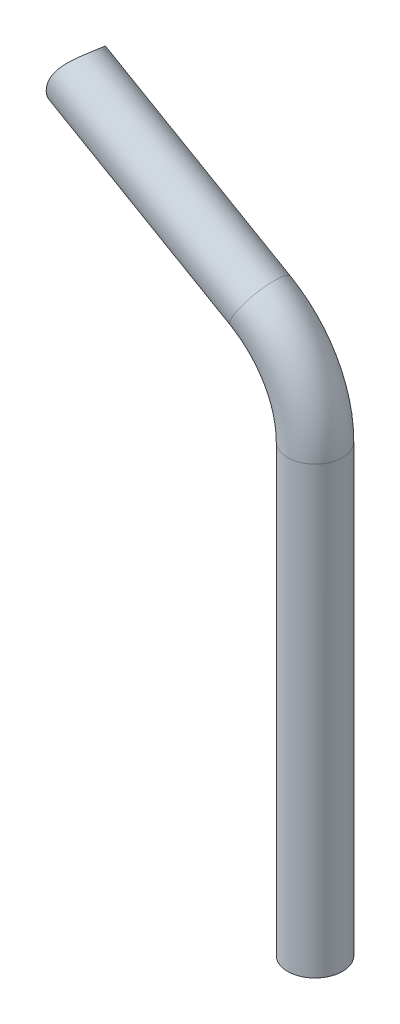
ISO-10303-21;
HEADER;
FILE_DESCRIPTION(('STEP AP214'),'2;1');
FILE_NAME('part.step','',(''),(''),'','','');
FILE_SCHEMA(('AUTOMOTIVE_DESIGN { 1 0 10303 214 1 1 1 1 }'));
ENDSEC;
DATA;
#1=APPLICATION_CONTEXT('core data for automotive mechanical design processes');
#2=APPLICATION_PROTOCOL_DEFINITION('international standard','automotive_design',2000,#1);
#3=PRODUCT_CONTEXT('',#1,'mechanical');
#4=PRODUCT('Part','Part','',(#3));
#5=PRODUCT_RELATED_PRODUCT_CATEGORY('part','',(#4));
#6=PRODUCT_DEFINITION_FORMATION('','',#4);
#7=PRODUCT_DEFINITION_CONTEXT('part definition',#1,'design');
#8=PRODUCT_DEFINITION('design','',#6,#7);
#9=PRODUCT_DEFINITION_SHAPE('','',#8);
#10=(LENGTH_UNIT() NAMED_UNIT(*) SI_UNIT(.MILLI.,.METRE.));
#11=(NAMED_UNIT(*) PLANE_ANGLE_UNIT() SI_UNIT($,.RADIAN.));
#12=(NAMED_UNIT(*) SI_UNIT($,.STERADIAN.) SOLID_ANGLE_UNIT());
#13=UNCERTAINTY_MEASURE_WITH_UNIT(LENGTH_MEASURE(1.E-05),#10,'distance_accuracy_value','');
#14=(GEOMETRIC_REPRESENTATION_CONTEXT(3) GLOBAL_UNCERTAINTY_ASSIGNED_CONTEXT((#13)) GLOBAL_UNIT_ASSIGNED_CONTEXT((#10,
#11,#12)) REPRESENTATION_CONTEXT('',''));
#15=CARTESIAN_POINT('',(0.,0.,0.));
#16=DIRECTION('',(0.,0.,1.));
#17=DIRECTION('',(1.,0.,0.));
#18=AXIS2_PLACEMENT_3D('',#15,#16,#17);
#19=CARTESIAN_POINT('',(125.,-72.1687836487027,0.));
#20=DIRECTION('',(-0.86602540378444,0.499999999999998,0.));
#21=DIRECTION('',(-0.499999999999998,-0.86602540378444,0.));
#22=AXIS2_PLACEMENT_3D('',#19,#20,#21);
#23=CYLINDRICAL_SURFACE('',#22,15.);
#24=CARTESIAN_POINT('',(19.6358840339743,-28.6572910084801,0.));
#25=CARTESIAN_POINT('',(19.6919861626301,-28.6896884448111,0.361385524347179));
#26=CARTESIAN_POINT('',(19.7488277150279,-28.7074131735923,0.723903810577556));
#27=CARTESIAN_POINT('',(19.8631855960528,-28.7126114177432,1.44915622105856));
#28=CARTESIAN_POINT('',(19.9207020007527,-28.7000814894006,1.81189036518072));
#29=CARTESIAN_POINT('',(20.0356450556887,-28.6441522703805,2.53510605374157));
#30=CARTESIAN_POINT('',(20.0930716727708,-28.6007434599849,2.89558686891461));
#31=CARTESIAN_POINT('',(20.2071591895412,-28.48291265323,3.61156587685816));
#32=CARTESIAN_POINT('',(20.2638201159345,-28.4084917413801,3.96706424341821));
#33=CARTESIAN_POINT('',(20.3758937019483,-28.2289255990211,4.67069749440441));
#34=CARTESIAN_POINT('',(20.431305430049,-28.1237582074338,5.01882687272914));
#35=CARTESIAN_POINT('',(20.5404707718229,-27.8835720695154,5.70489673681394));
#36=CARTESIAN_POINT('',(20.5942243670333,-27.7485529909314,6.04283710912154));
#37=CARTESIAN_POINT('',(20.6998792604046,-27.4499665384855,6.70616635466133));
#38=CARTESIAN_POINT('',(20.7517804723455,-27.2863978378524,7.03155464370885));
#39=CARTESIAN_POINT('',(20.8537097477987,-26.93240047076,7.66766504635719));
#40=CARTESIAN_POINT('',(20.90373779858,-26.741971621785,7.97838706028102));
#41=CARTESIAN_POINT('',(21.0018263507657,-26.3372371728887,8.58185797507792));
#42=CARTESIAN_POINT('',(21.0498954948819,-26.1230566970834,8.87468953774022));
#43=CARTESIAN_POINT('',(21.1446397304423,-25.6721410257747,9.4426431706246));
#44=CARTESIAN_POINT('',(21.191314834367,-25.435406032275,9.7177653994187));
#45=CARTESIAN_POINT('',(21.2837212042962,-24.941530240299,10.2491937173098));
#46=CARTESIAN_POINT('',(21.3294524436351,-24.684388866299,10.5054992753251));
#47=CARTESIAN_POINT('',(21.4205559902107,-24.1517620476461,10.9985217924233));
#48=CARTESIAN_POINT('',(21.4659281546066,-23.8762696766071,11.2352312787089));
#49=CARTESIAN_POINT('',(21.5617715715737,-23.2792054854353,11.7122042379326));
#50=CARTESIAN_POINT('',(21.6122762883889,-22.9558372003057,11.9502133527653));
#51=CARTESIAN_POINT('',(21.7147084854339,-22.2918956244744,12.4008179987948));
#52=CARTESIAN_POINT('',(21.7666365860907,-21.9513147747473,12.613402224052));
#53=CARTESIAN_POINT('',(21.8730743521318,-21.255455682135,13.0126171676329));
#54=CARTESIAN_POINT('',(21.9275851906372,-20.9001707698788,13.1992359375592));
#55=CARTESIAN_POINT('',(22.0404203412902,-20.1774607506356,13.5459425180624));
#56=CARTESIAN_POINT('',(22.0987449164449,-19.8100348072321,13.70602849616));
#57=CARTESIAN_POINT('',(22.228600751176,-19.016102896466,14.0185777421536));
#58=CARTESIAN_POINT('',(22.3008584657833,-18.5882103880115,14.1672323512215));
#59=CARTESIAN_POINT('',(22.4540157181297,-17.7231332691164,14.4291181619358));
#60=CARTESIAN_POINT('',(22.5349170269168,-17.2859467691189,14.5423420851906));
#61=CARTESIAN_POINT('',(22.7074799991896,-16.4055282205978,14.7324361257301));
#62=CARTESIAN_POINT('',(22.7991477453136,-15.9622928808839,14.8092855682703));
#63=CARTESIAN_POINT('',(22.9951912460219,-15.073909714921,14.9254058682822));
#64=CARTESIAN_POINT('',(23.0995605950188,-14.6287629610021,14.9646955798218));
#65=CARTESIAN_POINT('',(23.3236917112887,-13.7371309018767,15.0047356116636));
#66=CARTESIAN_POINT('',(23.4435591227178,-13.2906591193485,15.0052057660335));
#67=CARTESIAN_POINT('',(23.6995702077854,-12.4041345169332,14.9657744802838));
#68=CARTESIAN_POINT('',(23.8357141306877,-11.9640817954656,14.9258724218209));
#69=CARTESIAN_POINT('',(24.1248593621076,-11.0960118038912,14.8049638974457));
#70=CARTESIAN_POINT('',(24.2778344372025,-10.6679770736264,14.7240207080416));
#71=CARTESIAN_POINT('',(24.6006819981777,-9.82842789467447,14.520795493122));
#72=CARTESIAN_POINT('',(24.7705510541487,-9.41691011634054,14.3985218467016));
#73=CARTESIAN_POINT('',(25.1003834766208,-8.67301939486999,14.1336980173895));
#74=CARTESIAN_POINT('',(25.2582612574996,-8.33777235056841,13.9965883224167));
#75=CARTESIAN_POINT('',(25.5840597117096,-7.68585140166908,13.6932879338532));
#76=CARTESIAN_POINT('',(25.7519793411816,-7.36917557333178,13.5271002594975));
#77=CARTESIAN_POINT('',(26.0959130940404,-6.75673673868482,13.166886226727));
#78=CARTESIAN_POINT('',(26.2719277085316,-6.4609750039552,12.972858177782));
#79=CARTESIAN_POINT('',(26.6296667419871,-5.89216785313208,12.558566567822));
#80=CARTESIAN_POINT('',(26.8113911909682,-5.6191225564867,12.3383028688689));
#81=CARTESIAN_POINT('',(27.1662654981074,-5.11352397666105,11.8881293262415));
#82=CARTESIAN_POINT('',(27.3392282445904,-4.87950090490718,11.6597171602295));
#83=CARTESIAN_POINT('',(27.6856297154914,-4.4328992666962,11.1829788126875));
#84=CARTESIAN_POINT('',(27.8590685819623,-4.22032803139,10.934645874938));
#85=CARTESIAN_POINT('',(28.2040428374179,-3.81698098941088,10.4197726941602));
#86=CARTESIAN_POINT('',(28.3755786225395,-3.62620056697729,10.1532363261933));
#87=CARTESIAN_POINT('',(28.7146225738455,-3.26626576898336,9.60333174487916));
#88=CARTESIAN_POINT('',(28.8821288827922,-3.09712121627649,9.31995597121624));
#89=CARTESIAN_POINT('',(29.226008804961,-2.76577392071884,8.71116289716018));
#90=CARTESIAN_POINT('',(29.4017799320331,-2.60564233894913,8.38427650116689));
#91=CARTESIAN_POINT('',(29.7430815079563,-2.31073149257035,7.71431483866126));
#92=CARTESIAN_POINT('',(29.9086153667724,-2.17594375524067,7.37124503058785));
#93=CARTESIAN_POINT('',(30.2270710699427,-1.93113277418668,6.67034735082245));
#94=CARTESIAN_POINT('',(30.3799825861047,-1.82112968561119,6.3125077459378));
#95=CARTESIAN_POINT('',(30.6705419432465,-1.62565647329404,5.58430675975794));
#96=CARTESIAN_POINT('',(30.8081947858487,-1.54017829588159,5.21394953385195));
#97=CARTESIAN_POINT('',(31.0761434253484,-1.38754455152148,4.43286977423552));
#98=CARTESIAN_POINT('',(31.2050048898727,-1.32236341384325,4.02126607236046));
#99=CARTESIAN_POINT('',(31.4396194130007,-1.21964582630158,3.18810781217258));
#100=CARTESIAN_POINT('',(31.5453711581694,-1.18211094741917,2.76655268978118));
#101=CARTESIAN_POINT('',(31.7312713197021,-1.13430157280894,1.91637484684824));
#102=CARTESIAN_POINT('',(31.8114247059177,-1.12402178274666,1.48775351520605));
#103=CARTESIAN_POINT('',(31.9439978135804,-1.13030068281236,0.626434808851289));
#104=CARTESIAN_POINT('',(31.99641904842,-1.14685790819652,0.193737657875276));
#105=CARTESIAN_POINT('',(32.0706171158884,-1.20540824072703,-0.6589451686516));
#106=CARTESIAN_POINT('',(32.093296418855,-1.24659415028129,-1.0789075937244));
#107=CARTESIAN_POINT('',(32.1098535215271,-1.35318399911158,-1.91633319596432));
#108=CARTESIAN_POINT('',(32.1037317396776,-1.41858758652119,-2.33379640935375));
#109=CARTESIAN_POINT('',(32.062076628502,-1.57292962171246,-3.16271666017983));
#110=CARTESIAN_POINT('',(32.0265537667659,-1.66185968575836,-3.57417578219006));
#111=CARTESIAN_POINT('',(31.926063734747,-1.86247253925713,-4.38783970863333));
#112=CARTESIAN_POINT('',(31.8610979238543,-1.97415427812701,-4.79004493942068));
#113=CARTESIAN_POINT('',(31.7071726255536,-2.21178854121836,-5.55747903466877));
#114=CARTESIAN_POINT('',(31.6199377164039,-2.33643815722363,-5.923459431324));
#115=CARTESIAN_POINT('',(31.4209457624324,-2.60411809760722,-6.64175571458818));
#116=CARTESIAN_POINT('',(31.3091898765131,-2.74714755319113,-6.99407224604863));
#117=CARTESIAN_POINT('',(31.0624700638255,-3.05071044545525,-7.68266115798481));
#118=CARTESIAN_POINT('',(30.927505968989,-3.21124400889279,-8.01893342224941));
#119=CARTESIAN_POINT('',(30.6360340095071,-3.54893507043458,-8.67329691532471));
#120=CARTESIAN_POINT('',(30.4795256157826,-3.72609297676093,-8.99138769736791));
#121=CARTESIAN_POINT('',(30.145768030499,-4.09746299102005,-9.60963204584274));
#122=CARTESIAN_POINT('',(29.9683828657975,-4.29178458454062,-9.90964632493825));
#123=CARTESIAN_POINT('',(29.5959726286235,-4.69562422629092,-10.4876684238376));
#124=CARTESIAN_POINT('',(29.4009475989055,-4.90514223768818,-10.7656762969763));
#125=CARTESIAN_POINT('',(28.995593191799,-5.33873787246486,-11.2983395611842));
#126=CARTESIAN_POINT('',(28.7852596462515,-5.56281945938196,-11.5529885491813));
#127=CARTESIAN_POINT('',(28.3518504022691,-6.02491311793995,-12.0376319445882));
#128=CARTESIAN_POINT('',(28.1287737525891,-6.26292622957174,-12.2676245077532));
#129=CARTESIAN_POINT('',(27.6576466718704,-6.76834671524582,-12.7160048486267));
#130=CARTESIAN_POINT('',(27.4089160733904,-7.03665886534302,-12.9326601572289));
#131=CARTESIAN_POINT('',(26.9033017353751,-7.58805698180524,-13.33554579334));
#132=CARTESIAN_POINT('',(26.6464176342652,-7.87114360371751,-13.5217747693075));
#133=CARTESIAN_POINT('',(26.1278278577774,-8.45180952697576,-13.862750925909));
#134=CARTESIAN_POINT('',(25.8661199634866,-8.74939560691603,-14.0174832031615));
#135=CARTESIAN_POINT('',(25.3416285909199,-9.35848284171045,-14.2942472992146));
#136=CARTESIAN_POINT('',(25.0788451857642,-9.6699830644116,-14.4162813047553));
#137=CARTESIAN_POINT('',(24.5497460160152,-10.3139207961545,-14.6290992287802));
#138=CARTESIAN_POINT('',(24.2834941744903,-10.6466795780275,-14.7190738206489));
#139=CARTESIAN_POINT('',(23.7579783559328,-11.3253709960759,-14.8626117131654));
#140=CARTESIAN_POINT('',(23.4987145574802,-11.671303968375,-14.9161740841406));
#141=CARTESIAN_POINT('',(22.9917019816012,-12.3746846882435,-14.9859975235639));
#142=CARTESIAN_POINT('',(22.7439419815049,-12.7321206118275,-15.0022957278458));
#143=CARTESIAN_POINT('',(22.2638489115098,-13.456942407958,-14.9971850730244));
#144=CARTESIAN_POINT('',(22.0315138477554,-13.8243269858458,-14.9757810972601));
#145=CARTESIAN_POINT('',(21.6063855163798,-14.5327015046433,-14.8989519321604));
#146=CARTESIAN_POINT('',(21.4119182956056,-14.8730454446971,-14.8468051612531));
#147=CARTESIAN_POINT('',(21.0412769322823,-15.5575806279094,-14.7118292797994));
#148=CARTESIAN_POINT('',(20.8651015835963,-15.90177161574,-14.629002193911));
#149=CARTESIAN_POINT('',(20.5328851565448,-16.5913273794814,-14.4335796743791));
#150=CARTESIAN_POINT('',(20.3768406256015,-16.9366919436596,-14.3209893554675));
#151=CARTESIAN_POINT('',(20.085950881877,-17.6258722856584,-14.0673381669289));
#152=CARTESIAN_POINT('',(19.9511054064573,-17.9696880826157,-13.9262776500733));
#153=CARTESIAN_POINT('',(19.711267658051,-18.6301373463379,-13.6276311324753));
#154=CARTESIAN_POINT('',(19.604883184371,-18.9470528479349,-13.4717776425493));
#155=CARTESIAN_POINT('',(19.4106551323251,-19.5749193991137,-13.1381418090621));
#156=CARTESIAN_POINT('',(19.3228104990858,-19.8858707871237,-12.9603607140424));
#157=CARTESIAN_POINT('',(19.1650027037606,-20.4998210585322,-12.5843372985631));
#158=CARTESIAN_POINT('',(19.0950400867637,-20.8028196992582,-12.3860943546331));
#159=CARTESIAN_POINT('',(18.9720120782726,-21.399123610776,-11.9705224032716));
#160=CARTESIAN_POINT('',(18.9189529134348,-21.6924252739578,-11.75318640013));
#161=CARTESIAN_POINT('',(18.824374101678,-22.2944650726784,-11.2796579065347));
#162=CARTESIAN_POINT('',(18.7843956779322,-22.6020852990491,-11.0217322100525));
#163=CARTESIAN_POINT('',(18.7216079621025,-23.2015619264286,-10.4863958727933));
#164=CARTESIAN_POINT('',(18.6987993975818,-23.4934176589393,-10.208984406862));
#165=CARTESIAN_POINT('',(18.6535077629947,-24.3432327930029,-9.34889022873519));
#166=CARTESIAN_POINT('',(18.6541909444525,-24.8752175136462,-8.73852267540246));
#167=CARTESIAN_POINT('',(18.6931524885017,-25.6436461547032,-7.73123669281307));
#168=CARTESIAN_POINT('',(18.7151781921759,-25.9089760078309,-7.35506981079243));
#169=CARTESIAN_POINT('',(18.7726054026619,-26.4093946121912,-6.58383276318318));
#170=CARTESIAN_POINT('',(18.8080093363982,-26.6444778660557,-6.18875917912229));
#171=CARTESIAN_POINT('',(18.8898964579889,-27.0810309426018,-5.38230061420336));
#172=CARTESIAN_POINT('',(18.9363635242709,-27.2825489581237,-4.97094008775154));
#173=CARTESIAN_POINT('',(19.0382628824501,-27.6493280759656,-4.13360582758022));
#174=CARTESIAN_POINT('',(19.0936916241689,-27.8146034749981,-3.70763793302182));
#175=CARTESIAN_POINT('',(19.2250083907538,-28.1393142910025,-2.74432486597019));
#176=CARTESIAN_POINT('',(19.3026752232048,-28.2887512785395,-2.20380618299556));
#177=CARTESIAN_POINT('',(19.4649391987,-28.5228052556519,-1.10975212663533));
#178=CARTESIAN_POINT('',(19.5495358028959,-28.6074272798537,-0.556217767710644));
#179=CARTESIAN_POINT('',(19.6358840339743,-28.6572910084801,0.));
#180=B_SPLINE_CURVE_WITH_KNOTS('',3,(#24,#25,#26,#27,#28,#29,#30,#31,#32,#33,#34,#35,#36,#37,
#38,#39,#40,#41,#42,#43,#44,#45,#46,#47,#48,#49,#50,#51,#52,#53,#54,#55,#56,#57,#58,#59,#60,#61,
#62,#63,#64,#65,#66,#67,#68,#69,#70,#71,#72,#73,#74,#75,#76,#77,#78,#79,#80,#81,#82,#83,#84,#85,
#86,#87,#88,#89,#90,#91,#92,#93,#94,#95,#96,#97,#98,#99,#100,#101,#102,#103,#104,#105,#106,#107,
#108,#109,#110,#111,#112,#113,#114,#115,#116,#117,#118,#119,#120,#121,#122,#123,#124,#125,#126,
#127,#128,#129,#130,#131,#132,#133,#134,#135,#136,#137,#138,#139,#140,#141,#142,#143,#144,#145,
#146,#147,#148,#149,#150,#151,#152,#153,#154,#155,#156,#157,#158,#159,#160,#161,#162,#163,#164,
#165,#166,#167,#168,#169,#170,#171,#172,#173,#174,#175,#176,#177,#178,#179),.UNSPECIFIED.,.T.,
.F.,(4,2,2,2,2,2,2,2,2,2,2,2,2,2,2,2,2,2,2,2,2,2,2,2,2,2,2,2,2,2,2,2,2,2,2,2,2,2,2,2,2,2,2,2,2,
2,2,2,2,2,2,2,2,2,2,2,2,2,2,2,2,2,2,2,2,2,2,2,2,2,2,2,2,2,2,2,2,4),(0.,1.10100987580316,
2.20214507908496,3.30361990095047,4.40505620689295,5.50728835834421,6.60953277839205,
7.71182843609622,8.81413158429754,9.91088134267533,11.0076212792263,12.1043921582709,
13.2015793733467,14.4143936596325,15.6277452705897,16.8416533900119,18.0556453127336,
19.4302032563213,20.8050433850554,22.1806640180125,23.5555937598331,24.9404456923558,
26.3253188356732,27.7080632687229,29.0905275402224,30.2742858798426,31.4579213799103,
32.641628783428,33.8253424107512,34.9339850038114,36.0430052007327,37.1517900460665,
38.261076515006,39.4724428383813,40.6834034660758,41.8953453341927,43.1068887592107,
44.4138955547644,45.7209766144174,47.0278037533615,48.3345595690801,49.6006689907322,
50.8667600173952,52.1324004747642,53.3979825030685,54.5856026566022,55.7731666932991,
56.9607393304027,58.1483411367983,59.3441574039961,60.5399707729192,61.7361109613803,
62.93234055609,64.2065105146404,65.480737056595,66.7555651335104,68.030307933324,
69.3352674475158,70.6402602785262,71.9439520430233,73.2474749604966,74.4321971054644,
75.6168410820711,76.8012816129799,77.9857074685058,79.091041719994,80.196313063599,
81.301618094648,82.4073298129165,83.6163442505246,84.8254099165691,87.2443881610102,
88.6257138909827,90.0072903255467,91.3868656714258,92.7658958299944,94.46062013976,
96.1552127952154),.UNSPECIFIED.);
#181=CARTESIAN_POINT('',(19.6358840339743,-28.6572910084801,0.));
#182=VERTEX_POINT('',#181);
#183=EDGE_CURVE('E53',#182,#182,#180,.T.);
#184=ORIENTED_EDGE('',*,*,#183,.F.);
#185=EDGE_LOOP('',(#184));
#186=FACE_BOUND('',#185,.T.);
#187=CARTESIAN_POINT('',(125.,-72.1687836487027,0.));
#188=DIRECTION('',(-0.86602540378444,0.499999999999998,0.));
#189=DIRECTION('',(0.,0.,1.));
#190=AXIS2_PLACEMENT_3D('',#187,#188,#189);
#191=CIRCLE('',#190,15.);
#192=CARTESIAN_POINT('',(132.5,-59.1784025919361,0.));
#193=VERTEX_POINT('',#192);
#194=EDGE_CURVE('E10',#193,#193,#191,.T.);
#195=ORIENTED_EDGE('',*,*,#194,.T.);
#196=EDGE_LOOP('',(#195));
#197=FACE_BOUND('',#196,.T.);
#198=ADVANCED_FACE('F28',(#186,#197),#23,.T.);
#199=CARTESIAN_POINT('',(125.,-72.1687836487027,0.));
#200=DIRECTION('',(-0.86602540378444,0.499999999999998,0.));
#201=DIRECTION('',(-0.499999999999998,-0.86602540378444,0.));
#202=AXIS2_PLACEMENT_3D('',#199,#200,#201);
#203=CYLINDRICAL_SURFACE('',#202,13.);
#204=CARTESIAN_POINT('',(20.5365586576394,-26.8678946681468,0.));
#205=CARTESIAN_POINT('',(20.5809893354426,-26.8935459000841,0.322123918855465));
#206=CARTESIAN_POINT('',(20.6266877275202,-26.9060950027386,0.645138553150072));
#207=CARTESIAN_POINT('',(20.7199266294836,-26.9042458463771,1.29094259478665));
#208=CARTESIAN_POINT('',(20.7674677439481,-26.8898386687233,1.61373189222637));
#209=CARTESIAN_POINT('',(20.8637974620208,-26.8336150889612,2.25710759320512));
#210=CARTESIAN_POINT('',(20.9125873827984,-26.7917684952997,2.5776911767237));
#211=CARTESIAN_POINT('',(21.0108114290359,-26.6806074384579,3.213936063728));
#212=CARTESIAN_POINT('',(21.0602454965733,-26.6112954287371,3.52959780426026));
#213=CARTESIAN_POINT('',(21.1593310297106,-26.4455686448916,4.15374927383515));
#214=CARTESIAN_POINT('',(21.2089825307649,-26.3491492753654,4.46223777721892));
#215=CARTESIAN_POINT('',(21.3081808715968,-26.1300000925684,5.06974336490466));
#216=CARTESIAN_POINT('',(21.3577277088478,-26.0072696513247,5.36876022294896));
#217=CARTESIAN_POINT('',(21.4565283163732,-25.7366877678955,5.95517687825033));
#218=CARTESIAN_POINT('',(21.5057821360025,-25.5888406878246,6.24257868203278));
#219=CARTESIAN_POINT('',(21.6039675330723,-25.2694838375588,6.80396168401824));
#220=CARTESIAN_POINT('',(21.6528991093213,-25.0979739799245,7.0779428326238));
#221=CARTESIAN_POINT('',(21.7504406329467,-24.7333645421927,7.61034597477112));
#222=CARTESIAN_POINT('',(21.7990510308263,-24.5403093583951,7.86879833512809));
#223=CARTESIAN_POINT('',(21.896276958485,-24.134166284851,8.36942292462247));
#224=CARTESIAN_POINT('',(21.9448924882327,-23.9210785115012,8.61159524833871));
#225=CARTESIAN_POINT('',(22.0424756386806,-23.4767558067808,9.07861070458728));
#226=CARTESIAN_POINT('',(22.0914432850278,-23.2455195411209,9.30345256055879));
#227=CARTESIAN_POINT('',(22.1901891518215,-22.7667408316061,9.73501397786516));
#228=CARTESIAN_POINT('',(22.2399676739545,-22.5191922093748,9.94172660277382));
#229=CARTESIAN_POINT('',(22.3454468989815,-21.986523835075,10.3542381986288));
#230=CARTESIAN_POINT('',(22.4012740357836,-21.7000357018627,10.5582389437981));
#231=CARTESIAN_POINT('',(22.5153168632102,-21.1122165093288,10.9431134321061));
#232=CARTESIAN_POINT('',(22.5735336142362,-20.810878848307,11.1239767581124));
#233=CARTESIAN_POINT('',(22.6932289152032,-20.1956377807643,11.461937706));
#234=CARTESIAN_POINT('',(22.7547086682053,-19.8817297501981,11.6190264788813));
#235=CARTESIAN_POINT('',(22.8818457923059,-19.2436616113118,11.9088083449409));
#236=CARTESIAN_POINT('',(22.9475033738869,-18.9195009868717,12.04150020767));
#237=CARTESIAN_POINT('',(23.0910115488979,-18.2292348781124,12.2943402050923));
#238=CARTESIAN_POINT('',(23.169421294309,-17.8622511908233,12.4117836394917));
#239=CARTESIAN_POINT('',(23.3338420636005,-17.1213335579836,12.6155492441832));
#240=CARTESIAN_POINT('',(23.4198544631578,-16.7473983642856,12.7018657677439));
#241=CARTESIAN_POINT('',(23.6007696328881,-15.9955496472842,12.8425490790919));
#242=CARTESIAN_POINT('',(23.6956748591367,-15.6176350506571,12.8969070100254));
#243=CARTESIAN_POINT('',(23.8954491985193,-14.8613097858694,12.9727685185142));
#244=CARTESIAN_POINT('',(24.0003134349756,-14.4828994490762,12.9942880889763));
#245=CARTESIAN_POINT('',(24.220196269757,-13.7313616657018,13.0036930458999));
#246=CARTESIAN_POINT('',(24.3351414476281,-13.3582157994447,12.9918047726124));
#247=CARTESIAN_POINT('',(24.576303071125,-12.6181812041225,12.9342506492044));
#248=CARTESIAN_POINT('',(24.7025195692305,-12.2512925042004,12.8885846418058));
#249=CARTESIAN_POINT('',(24.9661158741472,-11.5278533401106,12.7632017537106));
#250=CARTESIAN_POINT('',(25.1034849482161,-11.1712933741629,12.6835173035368));
#251=CARTESIAN_POINT('',(25.38890067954,-10.4719246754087,12.490198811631));
#252=CARTESIAN_POINT('',(25.5369459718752,-10.1291141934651,12.3765691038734));
#253=CARTESIAN_POINT('',(25.8257000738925,-9.49748229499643,12.1302996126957));
#254=CARTESIAN_POINT('',(25.9654328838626,-9.20686303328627,12.0011113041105));
#255=CARTESIAN_POINT('',(26.2510678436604,-8.64161418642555,11.7171488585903));
#256=CARTESIAN_POINT('',(26.3969695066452,-8.3669833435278,11.5623767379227));
#257=CARTESIAN_POINT('',(26.6932980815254,-7.83563899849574,11.2283789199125));
#258=CARTESIAN_POINT('',(26.8437249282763,-7.57892523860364,11.0491535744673));
#259=CARTESIAN_POINT('',(27.1471971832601,-7.08493042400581,10.6676363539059));
#260=CARTESIAN_POINT('',(27.3002426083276,-6.8476494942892,10.4653443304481));
#261=CARTESIAN_POINT('',(27.6005305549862,-6.4030089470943,10.0480713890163));
#262=CARTESIAN_POINT('',(27.7477519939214,-6.19481876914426,9.83395825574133));
#263=CARTESIAN_POINT('',(28.0408188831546,-5.79789549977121,9.38737815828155));
#264=CARTESIAN_POINT('',(28.1866638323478,-5.60916926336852,9.1549047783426));
#265=CARTESIAN_POINT('',(28.4749606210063,-5.25167034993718,8.67323343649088));
#266=CARTESIAN_POINT('',(28.6174131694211,-5.08289347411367,8.42403901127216));
#267=CARTESIAN_POINT('',(28.8971122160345,-4.76533587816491,7.91027997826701));
#268=CARTESIAN_POINT('',(29.0343563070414,-4.61656432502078,7.64570840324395));
#269=CARTESIAN_POINT('',(29.3106387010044,-4.3298548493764,7.08466652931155));
#270=CARTESIAN_POINT('',(29.4491857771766,-4.19330198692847,6.78724570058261));
#271=CARTESIAN_POINT('',(29.7159393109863,-3.94300756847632,6.17865772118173));
#272=CARTESIAN_POINT('',(29.8441495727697,-3.82925759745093,5.86749569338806));
#273=CARTESIAN_POINT('',(30.0883035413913,-3.62425641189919,5.23291199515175));
#274=CARTESIAN_POINT('',(30.204238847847,-3.53302054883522,4.90948213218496));
#275=CARTESIAN_POINT('',(30.421742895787,-3.3729688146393,4.25253998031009));
#276=CARTESIAN_POINT('',(30.5233166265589,-3.30414514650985,3.91903124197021));
#277=CARTESIAN_POINT('',(30.7151821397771,-3.18564615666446,3.2261817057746));
#278=CARTESIAN_POINT('',(30.8046132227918,-3.13715190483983,2.86639919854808));
#279=CARTESIAN_POINT('',(30.9636674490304,-3.06440160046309,2.14004755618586));
#280=CARTESIAN_POINT('',(31.0332898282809,-3.04014648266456,1.77347815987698));
#281=CARTESIAN_POINT('',(31.1510108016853,-3.01557049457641,1.03615682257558));
#282=CARTESIAN_POINT('',(31.199113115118,-3.01524548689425,0.665405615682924));
#283=CARTESIAN_POINT('',(31.272399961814,-3.03815800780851,-0.0776313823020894));
#284=CARTESIAN_POINT('',(31.2975854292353,-3.06139457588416,-0.449917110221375));
#285=CARTESIAN_POINT('',(31.3236376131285,-3.13005852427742,-1.18328759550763));
#286=CARTESIAN_POINT('',(31.3251335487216,-3.17487902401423,-1.54440682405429));
#287=CARTESIAN_POINT('',(31.3048215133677,-3.28592146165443,-2.26268342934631));
#288=CARTESIAN_POINT('',(31.2830138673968,-3.35214310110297,-2.61984086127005));
#289=CARTESIAN_POINT('',(31.215916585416,-3.50536567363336,-3.32734769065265));
#290=CARTESIAN_POINT('',(31.1706321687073,-3.59236198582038,-3.67769858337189));
#291=CARTESIAN_POINT('',(31.0568303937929,-3.78643490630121,-4.36893206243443));
#292=CARTESIAN_POINT('',(30.98831363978,-3.89351099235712,-4.70981489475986));
#293=CARTESIAN_POINT('',(30.831982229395,-4.12218744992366,-5.36582117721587));
#294=CARTESIAN_POINT('',(30.7450676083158,-4.24301827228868,-5.68142827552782));
#295=CARTESIAN_POINT('',(30.551440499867,-4.50166638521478,-6.29931231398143));
#296=CARTESIAN_POINT('',(30.444728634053,-4.63948314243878,-6.60158967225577));
#297=CARTESIAN_POINT('',(30.212760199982,-4.93132867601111,-7.19081921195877));
#298=CARTESIAN_POINT('',(30.0875028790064,-5.08535811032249,-7.4777707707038));
#299=CARTESIAN_POINT('',(29.8199694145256,-5.40884661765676,-8.03452756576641));
#300=CARTESIAN_POINT('',(29.6776928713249,-5.57830605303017,-8.304332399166));
#301=CARTESIAN_POINT('',(29.3757681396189,-5.93437179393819,-8.8288206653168));
#302=CARTESIAN_POINT('',(29.2159048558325,-6.12118473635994,-9.0832398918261));
#303=CARTESIAN_POINT('',(28.8824764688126,-6.50915639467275,-9.57130063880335));
#304=CARTESIAN_POINT('',(28.7089112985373,-6.71031518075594,-9.80494205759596));
#305=CARTESIAN_POINT('',(28.3502028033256,-7.12632539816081,-10.2501708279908));
#306=CARTESIAN_POINT('',(28.1650578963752,-7.34117870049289,-10.4617551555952));
#307=CARTESIAN_POINT('',(27.7854159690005,-7.78400044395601,-10.8617367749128));
#308=CARTESIAN_POINT('',(27.5909156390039,-8.01197353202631,-11.0501257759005));
#309=CARTESIAN_POINT('',(27.1856892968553,-8.49138787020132,-11.4108577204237));
#310=CARTESIAN_POINT('',(26.9746302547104,-8.74342845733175,-11.5820315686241));
#311=CARTESIAN_POINT('',(26.5477526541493,-9.260508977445,-11.8966011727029));
#312=CARTESIAN_POINT('',(26.3319338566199,-9.52554956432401,-12.0399955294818));
#313=CARTESIAN_POINT('',(25.8984261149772,-10.0679812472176,-12.2980027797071));
#314=CARTESIAN_POINT('',(25.6807366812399,-10.3453756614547,-12.4126078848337));
#315=CARTESIAN_POINT('',(25.2466728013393,-10.9114948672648,-12.6119999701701));
#316=CARTESIAN_POINT('',(25.030297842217,-11.200214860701,-12.6967994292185));
#317=CARTESIAN_POINT('',(24.6025356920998,-11.7871387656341,-12.8356081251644));
#318=CARTESIAN_POINT('',(24.3911350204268,-12.0853101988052,-12.8897128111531));
#319=CARTESIAN_POINT('',(23.9756907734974,-12.6906864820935,-12.9669057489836));
#320=CARTESIAN_POINT('',(23.7716472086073,-12.9978913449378,-12.9899939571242));
#321=CARTESIAN_POINT('',(23.3740255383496,-13.6194710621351,-13.0047749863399));
#322=CARTESIAN_POINT('',(23.1804405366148,-13.9338409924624,-12.9964887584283));
#323=CARTESIAN_POINT('',(22.8063427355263,-14.5679144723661,-12.9485377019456));
#324=CARTESIAN_POINT('',(22.6258288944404,-14.887617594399,-12.9088753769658));
#325=CARTESIAN_POINT('',(22.2930837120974,-15.5060997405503,-12.802670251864));
#326=CARTESIAN_POINT('',(22.1397474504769,-15.8046674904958,-12.738344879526));
#327=CARTESIAN_POINT('',(21.8477704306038,-16.4022678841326,-12.5837890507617));
#328=CARTESIAN_POINT('',(21.7091288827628,-16.7013005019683,-12.4935599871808));
#329=CARTESIAN_POINT('',(21.4475704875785,-17.2976475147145,-12.2881326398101));
#330=CARTESIAN_POINT('',(21.3246536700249,-17.5949619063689,-12.1729343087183));
#331=CARTESIAN_POINT('',(21.0950984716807,-18.1856686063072,-11.9187472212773));
#332=CARTESIAN_POINT('',(20.9884603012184,-18.4790608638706,-11.7797581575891));
#333=CARTESIAN_POINT('',(20.7937822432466,-19.0532253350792,-11.4827248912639));
#334=CARTESIAN_POINT('',(20.7053777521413,-19.3341329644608,-11.3251800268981));
#335=CARTESIAN_POINT('',(20.5439132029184,-19.8883421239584,-10.9899262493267));
#336=CARTESIAN_POINT('',(20.4708586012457,-20.1616409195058,-10.8122102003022));
#337=CARTESIAN_POINT('',(20.3395769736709,-20.6987088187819,-10.438040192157));
#338=CARTESIAN_POINT('',(20.2813471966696,-20.9624796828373,-10.2415897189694));
#339=CARTESIAN_POINT('',(20.1788944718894,-21.4789979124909,-9.83115852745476));
#340=CARTESIAN_POINT('',(20.1346766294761,-21.7317412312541,-9.6171714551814));
#341=CARTESIAN_POINT('',(20.0559545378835,-22.2467878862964,-9.1529451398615));
#342=CARTESIAN_POINT('',(20.0226836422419,-22.507902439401,-8.90117662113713));
#343=CARTESIAN_POINT('',(19.9704055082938,-23.0132414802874,-8.3798400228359));
#344=CARTESIAN_POINT('',(19.9513990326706,-23.257465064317,-8.11027099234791));
#345=CARTESIAN_POINT('',(19.9262773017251,-23.7274713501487,-7.55443833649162));
#346=CARTESIAN_POINT('',(19.9201761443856,-23.9532336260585,-7.26815680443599));
#347=CARTESIAN_POINT('',(19.9195416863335,-24.3842302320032,-6.68052164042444));
#348=CARTESIAN_POINT('',(19.9250087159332,-24.5894639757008,-6.37916757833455));
#349=CARTESIAN_POINT('',(19.9471410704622,-24.995364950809,-5.73451226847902));
#350=CARTESIAN_POINT('',(19.9647851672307,-25.1938964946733,-5.38989573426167));
#351=CARTESIAN_POINT('',(20.0105765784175,-25.5619842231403,-4.68608214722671));
#352=CARTESIAN_POINT('',(20.0387260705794,-25.7315343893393,-4.32688208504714));
#353=CARTESIAN_POINT('',(20.1038168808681,-26.038789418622,-3.59692350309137));
#354=CARTESIAN_POINT('',(20.1407359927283,-26.1765730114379,-3.22619620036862));
#355=CARTESIAN_POINT('',(20.2218289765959,-26.4183610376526,-2.47483790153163));
#356=CARTESIAN_POINT('',(20.2659983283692,-26.5223863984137,-2.09421319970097));
#357=CARTESIAN_POINT('',(20.347561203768,-26.6715356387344,-1.42812565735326));
#358=CARTESIAN_POINT('',(20.3836231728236,-26.7249687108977,-1.14433696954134));
#359=CARTESIAN_POINT('',(20.4583063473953,-26.8117108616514,-0.573935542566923));
#360=CARTESIAN_POINT('',(20.4969282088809,-26.8450147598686,-0.287322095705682));
#361=CARTESIAN_POINT('',(20.5365586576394,-26.8678946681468,0.));
#362=B_SPLINE_CURVE_WITH_KNOTS('',3,(#204,#205,#206,#207,#208,#209,#210,#211,#212,#213,#214,
#215,#216,#217,#218,#219,#220,#221,#222,#223,#224,#225,#226,#227,#228,#229,#230,#231,#232,#233,
#234,#235,#236,#237,#238,#239,#240,#241,#242,#243,#244,#245,#246,#247,#248,#249,#250,#251,#252,
#253,#254,#255,#256,#257,#258,#259,#260,#261,#262,#263,#264,#265,#266,#267,#268,#269,#270,#271,
#272,#273,#274,#275,#276,#277,#278,#279,#280,#281,#282,#283,#284,#285,#286,#287,#288,#289,#290,
#291,#292,#293,#294,#295,#296,#297,#298,#299,#300,#301,#302,#303,#304,#305,#306,#307,#308,#309,
#310,#311,#312,#313,#314,#315,#316,#317,#318,#319,#320,#321,#322,#323,#324,#325,#326,#327,#328,
#329,#330,#331,#332,#333,#334,#335,#336,#337,#338,#339,#340,#341,#342,#343,#344,#345,#346,#347,
#348,#349,#350,#351,#352,#353,#354,#355,#356,#357,#358,#359,#360,#361),.UNSPECIFIED.,.T.,.F.,(4,
2,2,2,2,2,2,2,2,2,2,2,2,2,2,2,2,2,2,2,2,2,2,2,2,2,2,2,2,2,2,2,2,2,2,2,2,2,2,2,2,2,2,2,2,2,2,2,2,
2,2,2,2,2,2,2,2,2,2,2,2,2,2,2,2,2,2,2,2,2,2,2,2,2,2,2,2,2,4),(0.,0.978308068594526,
1.95693987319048,2.93665027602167,3.91627318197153,4.8960622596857,5.87587472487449,
6.85551719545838,7.83516328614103,8.81282674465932,9.79048452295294,10.7682142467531,
11.746316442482,12.8135095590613,13.8811814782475,14.9492498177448,16.0173720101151,
17.1956438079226,18.3741292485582,19.5529411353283,20.7311787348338,21.901452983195,
23.0717326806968,24.2408992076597,25.4099165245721,26.4507288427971,27.4914591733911,
28.5321745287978,29.5728965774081,30.5706833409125,31.5688203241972,32.5667468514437,
33.5651291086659,34.6301226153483,35.6947223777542,36.7600460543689,37.8249987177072,
38.9452988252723,40.065642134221,41.1857917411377,42.3058956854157,43.3961970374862,
44.486483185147,45.5765270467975,46.666542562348,47.7121456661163,48.7577159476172,
49.8033286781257,50.8489659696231,51.9092248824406,52.969488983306,54.0298982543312,
55.0906854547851,56.2012912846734,57.3119530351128,58.4229149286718,59.5334111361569,
60.6404349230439,61.7474602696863,62.8537465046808,63.9599444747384,64.9839096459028,
66.0078197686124,67.0317318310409,68.0556571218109,69.0565346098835,70.0577672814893,
71.0588140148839,72.0602250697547,73.1518178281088,74.2434689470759,75.3363119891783,
76.429186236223,77.6220476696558,78.8151565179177,80.0052758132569,81.1946559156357,
82.0670445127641,82.9396575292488),.UNSPECIFIED.);
#363=CARTESIAN_POINT('',(20.5365586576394,-26.8678946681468,0.));
#364=VERTEX_POINT('',#363);
#365=EDGE_CURVE('E32',#364,#364,#362,.T.);
#366=ORIENTED_EDGE('',*,*,#365,.T.);
#367=EDGE_LOOP('',(#366));
#368=FACE_BOUND('',#367,.T.);
#369=CARTESIAN_POINT('',(125.,-72.1687836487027,0.));
#370=DIRECTION('',(-0.86602540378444,0.499999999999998,0.));
#371=DIRECTION('',(0.,0.,1.));
#372=AXIS2_PLACEMENT_3D('',#369,#370,#371);
#373=CIRCLE('',#372,13.);
#374=CARTESIAN_POINT('',(131.5,-60.910453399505,0.));
#375=VERTEX_POINT('',#374);
#376=EDGE_CURVE('E39',#375,#375,#373,.T.);
#377=ORIENTED_EDGE('',*,*,#376,.F.);
#378=EDGE_LOOP('',(#377));
#379=FACE_BOUND('',#378,.T.);
#380=ADVANCED_FACE('F85',(#368,#379),#203,.F.);
#381=CARTESIAN_POINT('',(95.,-124.130307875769,0.));
#382=DIRECTION('',(0.,0.,1.));
#383=DIRECTION('',(1.,0.,0.));
#384=AXIS2_PLACEMENT_3D('',#381,#382,#383);
#385=TOROIDAL_SURFACE('',#384,60.,15.);
#386=CARTESIAN_POINT('',(155.,-124.130307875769,0.));
#387=DIRECTION('',(0.,1.,0.));
#388=DIRECTION('',(0.,0.,1.));
#389=AXIS2_PLACEMENT_3D('',#386,#387,#388);
#390=CIRCLE('',#389,15.);
#391=CARTESIAN_POINT('',(170.,-124.130307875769,0.));
#392=VERTEX_POINT('',#391);
#393=EDGE_CURVE('E43',#392,#392,#390,.T.);
#394=CARTESIAN_POINT('',(95.,-124.130307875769,0.));
#395=DIRECTION('',(0.,0.,1.));
#396=DIRECTION('',(1.,0.,0.));
#397=AXIS2_PLACEMENT_3D('',#394,#395,#396);
#398=CIRCLE('',#397,75.);
#399=EDGE_CURVE('',#392,#193,#398,.T.);
#400=ORIENTED_EDGE('',*,*,#393,.T.);
#401=ORIENTED_EDGE('',*,*,#194,.F.);
#402=ORIENTED_EDGE('',*,*,#399,.T.);
#403=ORIENTED_EDGE('',*,*,#399,.F.);
#404=EDGE_LOOP('',(#400,#402,#401,#403));
#405=FACE_BOUND('',#404,.T.);
#406=ADVANCED_FACE('F82',(#405),#385,.T.);
#407=CARTESIAN_POINT('',(95.,-124.130307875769,0.));
#408=DIRECTION('',(0.,0.,1.));
#409=DIRECTION('',(1.,0.,0.));
#410=AXIS2_PLACEMENT_3D('',#407,#408,#409);
#411=TOROIDAL_SURFACE('',#410,60.,13.);
#412=CARTESIAN_POINT('',(155.,-124.130307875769,0.));
#413=DIRECTION('',(0.,1.,0.));
#414=DIRECTION('',(0.,0.,1.));
#415=AXIS2_PLACEMENT_3D('',#412,#413,#414);
#416=CIRCLE('',#415,13.);
#417=CARTESIAN_POINT('',(168.,-124.130307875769,0.));
#418=VERTEX_POINT('',#417);
#419=EDGE_CURVE('E49',#418,#418,#416,.T.);
#420=CARTESIAN_POINT('',(95.,-124.130307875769,0.));
#421=DIRECTION('',(0.,0.,1.));
#422=DIRECTION('',(1.,0.,0.));
#423=AXIS2_PLACEMENT_3D('',#420,#421,#422);
#424=CIRCLE('',#423,73.);
#425=EDGE_CURVE('',#418,#375,#424,.T.);
#426=ORIENTED_EDGE('',*,*,#419,.F.);
#427=ORIENTED_EDGE('',*,*,#376,.T.);
#428=ORIENTED_EDGE('',*,*,#425,.T.);
#429=ORIENTED_EDGE('',*,*,#425,.F.);
#430=EDGE_LOOP('',(#426,#428,#427,#429));
#431=FACE_BOUND('',#430,.T.);
#432=ADVANCED_FACE('F78',(#431),#411,.F.);
#433=CARTESIAN_POINT('',(155.,-124.130307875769,0.));
#434=DIRECTION('',(0.,-1.,0.));
#435=DIRECTION('',(0.,0.,-1.));
#436=AXIS2_PLACEMENT_3D('',#433,#434,#435);
#437=CYLINDRICAL_SURFACE('',#436,13.);
#438=ORIENTED_EDGE('',*,*,#419,.T.);
#439=EDGE_LOOP('',(#438));
#440=FACE_BOUND('',#439,.T.);
#441=CARTESIAN_POINT('',(155.,-367.489291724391,0.));
#442=DIRECTION('',(0.,1.,0.));
#443=DIRECTION('',(0.,0.,1.));
#444=AXIS2_PLACEMENT_3D('',#441,#442,#443);
#445=CIRCLE('',#444,13.);
#446=CARTESIAN_POINT('',(155.,-367.489291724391,13.));
#447=VERTEX_POINT('',#446);
#448=EDGE_CURVE('E50',#447,#447,#445,.T.);
#449=ORIENTED_EDGE('',*,*,#448,.F.);
#450=EDGE_LOOP('',(#449));
#451=FACE_BOUND('',#450,.T.);
#452=ADVANCED_FACE('F74',(#440,#451),#437,.F.);
#453=CARTESIAN_POINT('',(155.,-124.130307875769,0.));
#454=DIRECTION('',(0.,-1.,0.));
#455=DIRECTION('',(0.,0.,-1.));
#456=AXIS2_PLACEMENT_3D('',#453,#454,#455);
#457=CYLINDRICAL_SURFACE('',#456,15.);
#458=ORIENTED_EDGE('',*,*,#393,.F.);
#459=EDGE_LOOP('',(#458));
#460=FACE_BOUND('',#459,.T.);
#461=CARTESIAN_POINT('',(155.,-367.489291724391,0.));
#462=DIRECTION('',(0.,1.,0.));
#463=DIRECTION('',(0.,0.,1.));
#464=AXIS2_PLACEMENT_3D('',#461,#462,#463);
#465=CIRCLE('',#464,15.);
#466=CARTESIAN_POINT('',(155.,-367.489291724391,15.));
#467=VERTEX_POINT('',#466);
#468=EDGE_CURVE('E46',#467,#467,#465,.T.);
#469=ORIENTED_EDGE('',*,*,#468,.T.);
#470=EDGE_LOOP('',(#469));
#471=FACE_BOUND('',#470,.T.);
#472=ADVANCED_FACE('F70',(#460,#471),#457,.T.);
#473=CARTESIAN_POINT('',(155.,-367.489291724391,0.));
#474=DIRECTION('',(0.,1.,0.));
#475=DIRECTION('',(0.,0.,1.));
#476=AXIS2_PLACEMENT_3D('',#473,#474,#475);
#477=PLANE('',#476);
#478=ORIENTED_EDGE('',*,*,#448,.T.);
#479=EDGE_LOOP('',(#478));
#480=FACE_BOUND('',#479,.T.);
#481=ORIENTED_EDGE('',*,*,#468,.F.);
#482=EDGE_LOOP('',(#481));
#483=FACE_BOUND('',#482,.T.);
#484=ADVANCED_FACE('F65',(#480,#483),#477,.F.);
#485=CARTESIAN_POINT('',(-14.1517980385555,-32.3119504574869,11.1653244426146));
#486=DIRECTION('',(0.382481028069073,0.873295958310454,-0.301765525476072));
#487=DIRECTION('',(-0.915997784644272,0.401183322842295,0.));
#488=AXIS2_PLACEMENT_3D('',#485,#486,#487);
#489=CYLINDRICAL_SURFACE('',#488,29.9999999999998);
#490=ORIENTED_EDGE('',*,*,#183,.T.);
#491=EDGE_LOOP('',(#490));
#492=FACE_BOUND('',#491,.T.);
#493=ORIENTED_EDGE('',*,*,#365,.F.);
#494=EDGE_LOOP('',(#493));
#495=FACE_BOUND('',#494,.T.);
#496=ADVANCED_FACE('F61',(#492,#495),#489,.F.);
#497=CLOSED_SHELL('',(#198,#380,#406,#432,#452,#472,#484,#496));
#498=MANIFOLD_SOLID_BREP('B2',#497);
#499=ADVANCED_BREP_SHAPE_REPRESENTATION('',(#18,#498),#14);
#500=SHAPE_DEFINITION_REPRESENTATION(#9,#499);
ENDSEC;
END-ISO-10303-21;
